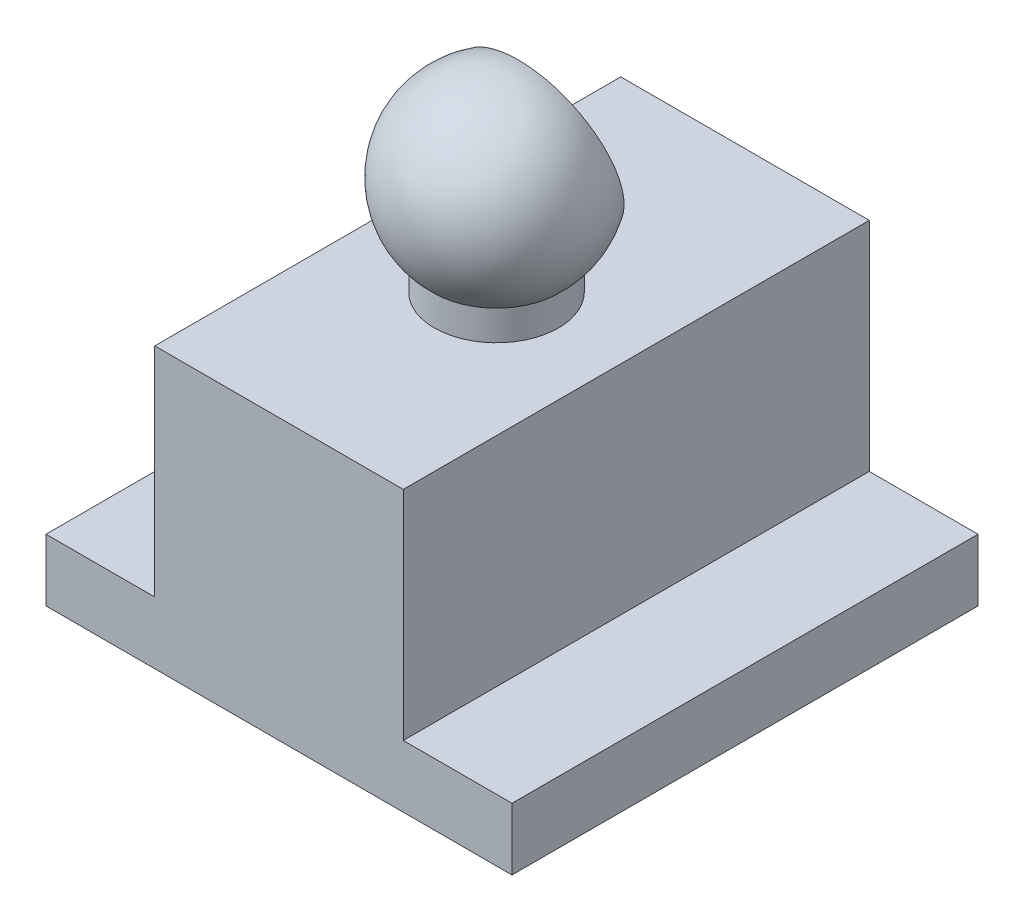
ISO-10303-21;
HEADER;
FILE_DESCRIPTION(('STEP AP214'),'2;1');
FILE_NAME('part.step','',(''),(''),'','','');
FILE_SCHEMA(('AUTOMOTIVE_DESIGN { 1 0 10303 214 1 1 1 1 }'));
ENDSEC;
DATA;
#1=APPLICATION_CONTEXT('core data for automotive mechanical design processes');
#2=APPLICATION_PROTOCOL_DEFINITION('international standard','automotive_design',2000,#1);
#3=PRODUCT_CONTEXT('',#1,'mechanical');
#4=PRODUCT('Part','Part','',(#3));
#5=PRODUCT_RELATED_PRODUCT_CATEGORY('part','',(#4));
#6=PRODUCT_DEFINITION_FORMATION('','',#4);
#7=PRODUCT_DEFINITION_CONTEXT('part definition',#1,'design');
#8=PRODUCT_DEFINITION('design','',#6,#7);
#9=PRODUCT_DEFINITION_SHAPE('','',#8);
#10=(LENGTH_UNIT() NAMED_UNIT(*) SI_UNIT(.MILLI.,.METRE.));
#11=(NAMED_UNIT(*) PLANE_ANGLE_UNIT() SI_UNIT($,.RADIAN.));
#12=(NAMED_UNIT(*) SI_UNIT($,.STERADIAN.) SOLID_ANGLE_UNIT());
#13=UNCERTAINTY_MEASURE_WITH_UNIT(LENGTH_MEASURE(1.E-05),#10,'distance_accuracy_value','');
#14=(GEOMETRIC_REPRESENTATION_CONTEXT(3) GLOBAL_UNCERTAINTY_ASSIGNED_CONTEXT((#13)) GLOBAL_UNIT_ASSIGNED_CONTEXT((#10,
#11,#12)) REPRESENTATION_CONTEXT('',''));
#15=CARTESIAN_POINT('',(0.,0.,0.));
#16=DIRECTION('',(0.,0.,1.));
#17=DIRECTION('',(1.,0.,0.));
#18=AXIS2_PLACEMENT_3D('',#15,#16,#17);
#19=CARTESIAN_POINT('',(20.,20.,-75.));
#20=DIRECTION('',(0.,1.,0.));
#21=DIRECTION('',(-1.,0.,0.));
#22=AXIS2_PLACEMENT_3D('',#19,#20,#21);
#23=PLANE('',#22);
#24=DIRECTION('',(-1.,0.,0.));
#25=VECTOR('',#24,1.);
#26=CARTESIAN_POINT('',(20.,20.,0.));
#27=LINE('',#26,#25);
#28=CARTESIAN_POINT('',(37.5,20.,0.));
#29=VERTEX_POINT('',#28);
#30=CARTESIAN_POINT('',(20.,20.,0.));
#31=VERTEX_POINT('',#30);
#32=EDGE_CURVE('E100',#29,#31,#27,.T.);
#33=ORIENTED_EDGE('',*,*,#32,.F.);
#34=DIRECTION('',(0.,0.,1.));
#35=VECTOR('',#34,1.);
#36=CARTESIAN_POINT('',(37.5,20.,-75.));
#37=LINE('',#36,#35);
#38=CARTESIAN_POINT('',(37.5,20.,-75.));
#39=VERTEX_POINT('',#38);
#40=EDGE_CURVE('E11',#39,#29,#37,.T.);
#41=ORIENTED_EDGE('',*,*,#40,.F.);
#42=DIRECTION('',(-1.,0.,0.));
#43=VECTOR('',#42,1.);
#44=CARTESIAN_POINT('',(20.,20.,-75.));
#45=LINE('',#44,#43);
#46=CARTESIAN_POINT('',(20.,20.,-75.));
#47=VERTEX_POINT('',#46);
#48=EDGE_CURVE('E102',#39,#47,#45,.T.);
#49=ORIENTED_EDGE('',*,*,#48,.T.);
#50=DIRECTION('',(0.,0.,1.));
#51=VECTOR('',#50,1.);
#52=CARTESIAN_POINT('',(20.,20.,-75.));
#53=LINE('',#52,#51);
#54=EDGE_CURVE('E39',#47,#31,#53,.T.);
#55=ORIENTED_EDGE('',*,*,#54,.T.);
#56=EDGE_LOOP('',(#33,#41,#49,#55));
#57=FACE_BOUND('',#56,.T.);
#58=ADVANCED_FACE('F36',(#57),#23,.T.);
#59=CARTESIAN_POINT('',(37.5,20.,-75.));
#60=DIRECTION('',(1.,0.,0.));
#61=DIRECTION('',(0.,0.,-1.));
#62=AXIS2_PLACEMENT_3D('',#59,#60,#61);
#63=PLANE('',#62);
#64=DIRECTION('',(0.,1.,0.));
#65=VECTOR('',#64,1.);
#66=CARTESIAN_POINT('',(37.5,20.,0.));
#67=LINE('',#66,#65);
#68=CARTESIAN_POINT('',(37.5,10.,0.));
#69=VERTEX_POINT('',#68);
#70=EDGE_CURVE('E118',#69,#29,#67,.T.);
#71=ORIENTED_EDGE('',*,*,#70,.F.);
#72=DIRECTION('',(0.,0.,1.));
#73=VECTOR('',#72,1.);
#74=CARTESIAN_POINT('',(37.5,10.,-75.));
#75=LINE('',#74,#73);
#76=CARTESIAN_POINT('',(37.5,10.,-75.));
#77=VERTEX_POINT('',#76);
#78=EDGE_CURVE('E44',#77,#69,#75,.T.);
#79=ORIENTED_EDGE('',*,*,#78,.F.);
#80=DIRECTION('',(0.,1.,0.));
#81=VECTOR('',#80,1.);
#82=CARTESIAN_POINT('',(37.5,20.,-75.));
#83=LINE('',#82,#81);
#84=EDGE_CURVE('E107',#77,#39,#83,.T.);
#85=ORIENTED_EDGE('',*,*,#84,.T.);
#86=ORIENTED_EDGE('',*,*,#40,.T.);
#87=EDGE_LOOP('',(#71,#79,#85,#86));
#88=FACE_BOUND('',#87,.T.);
#89=ADVANCED_FACE('F184',(#88),#63,.T.);
#90=CARTESIAN_POINT('',(37.5,10.,-75.));
#91=DIRECTION('',(0.,-1.,0.));
#92=DIRECTION('',(1.,0.,0.));
#93=AXIS2_PLACEMENT_3D('',#90,#91,#92);
#94=PLANE('',#93);
#95=DIRECTION('',(1.,0.,0.));
#96=VECTOR('',#95,1.);
#97=CARTESIAN_POINT('',(37.5,10.,0.));
#98=LINE('',#97,#96);
#99=CARTESIAN_POINT('',(-37.5,9.99999999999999,0.));
#100=VERTEX_POINT('',#99);
#101=EDGE_CURVE('E136',#100,#69,#98,.T.);
#102=ORIENTED_EDGE('',*,*,#101,.F.);
#103=DIRECTION('',(0.,0.,1.));
#104=VECTOR('',#103,1.);
#105=CARTESIAN_POINT('',(-37.5,9.99999999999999,-75.));
#106=LINE('',#105,#104);
#107=CARTESIAN_POINT('',(-37.5,9.99999999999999,-75.));
#108=VERTEX_POINT('',#107);
#109=EDGE_CURVE('E158',#108,#100,#106,.T.);
#110=ORIENTED_EDGE('',*,*,#109,.F.);
#111=DIRECTION('',(1.,0.,0.));
#112=VECTOR('',#111,1.);
#113=CARTESIAN_POINT('',(37.5,10.,-75.));
#114=LINE('',#113,#112);
#115=EDGE_CURVE('E154',#108,#77,#114,.T.);
#116=ORIENTED_EDGE('',*,*,#115,.T.);
#117=ORIENTED_EDGE('',*,*,#78,.T.);
#118=EDGE_LOOP('',(#102,#110,#116,#117));
#119=FACE_BOUND('',#118,.T.);
#120=ADVANCED_FACE('F183',(#119),#94,.T.);
#121=CARTESIAN_POINT('',(-37.5,9.99999999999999,-75.));
#122=DIRECTION('',(-1.,0.,0.));
#123=DIRECTION('',(0.,0.,1.));
#124=AXIS2_PLACEMENT_3D('',#121,#122,#123);
#125=PLANE('',#124);
#126=DIRECTION('',(0.,-1.,0.));
#127=VECTOR('',#126,1.);
#128=CARTESIAN_POINT('',(-37.5,9.99999999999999,0.));
#129=LINE('',#128,#127);
#130=CARTESIAN_POINT('',(-37.5,20.,0.));
#131=VERTEX_POINT('',#130);
#132=EDGE_CURVE('E133',#131,#100,#129,.T.);
#133=ORIENTED_EDGE('',*,*,#132,.F.);
#134=DIRECTION('',(0.,0.,1.));
#135=VECTOR('',#134,1.);
#136=CARTESIAN_POINT('',(-37.5,20.,-75.));
#137=LINE('',#136,#135);
#138=CARTESIAN_POINT('',(-37.5,20.,-75.));
#139=VERTEX_POINT('',#138);
#140=EDGE_CURVE('E160',#139,#131,#137,.T.);
#141=ORIENTED_EDGE('',*,*,#140,.F.);
#142=DIRECTION('',(0.,-1.,0.));
#143=VECTOR('',#142,1.);
#144=CARTESIAN_POINT('',(-37.5,9.99999999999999,-75.));
#145=LINE('',#144,#143);
#146=EDGE_CURVE('E151',#139,#108,#145,.T.);
#147=ORIENTED_EDGE('',*,*,#146,.T.);
#148=ORIENTED_EDGE('',*,*,#109,.T.);
#149=EDGE_LOOP('',(#133,#141,#147,#148));
#150=FACE_BOUND('',#149,.T.);
#151=ADVANCED_FACE('F179',(#150),#125,.T.);
#152=CARTESIAN_POINT('',(-37.5,20.,-75.));
#153=DIRECTION('',(0.,1.,0.));
#154=DIRECTION('',(-1.,0.,0.));
#155=AXIS2_PLACEMENT_3D('',#152,#153,#154);
#156=PLANE('',#155);
#157=DIRECTION('',(-1.,0.,0.));
#158=VECTOR('',#157,1.);
#159=CARTESIAN_POINT('',(-37.5,20.,0.));
#160=LINE('',#159,#158);
#161=CARTESIAN_POINT('',(-20.,20.,0.));
#162=VERTEX_POINT('',#161);
#163=EDGE_CURVE('E130',#162,#131,#160,.T.);
#164=ORIENTED_EDGE('',*,*,#163,.F.);
#165=DIRECTION('',(0.,0.,1.));
#166=VECTOR('',#165,1.);
#167=CARTESIAN_POINT('',(-20.,20.,-75.));
#168=LINE('',#167,#166);
#169=CARTESIAN_POINT('',(-20.,20.,-75.));
#170=VERTEX_POINT('',#169);
#171=EDGE_CURVE('E162',#170,#162,#168,.T.);
#172=ORIENTED_EDGE('',*,*,#171,.F.);
#173=DIRECTION('',(-1.,0.,0.));
#174=VECTOR('',#173,1.);
#175=CARTESIAN_POINT('',(-37.5,20.,-75.));
#176=LINE('',#175,#174);
#177=EDGE_CURVE('E148',#170,#139,#176,.T.);
#178=ORIENTED_EDGE('',*,*,#177,.T.);
#179=ORIENTED_EDGE('',*,*,#140,.T.);
#180=EDGE_LOOP('',(#164,#172,#178,#179));
#181=FACE_BOUND('',#180,.T.);
#182=ADVANCED_FACE('F175',(#181),#156,.T.);
#183=CARTESIAN_POINT('',(-20.,20.,-75.));
#184=DIRECTION('',(-1.,0.,0.));
#185=DIRECTION('',(0.,0.,1.));
#186=AXIS2_PLACEMENT_3D('',#183,#184,#185);
#187=PLANE('',#186);
#188=DIRECTION('',(0.,-1.,0.));
#189=VECTOR('',#188,1.);
#190=CARTESIAN_POINT('',(-20.,20.,0.));
#191=LINE('',#190,#189);
#192=CARTESIAN_POINT('',(-20.,55.,0.));
#193=VERTEX_POINT('',#192);
#194=EDGE_CURVE('E127',#193,#162,#191,.T.);
#195=ORIENTED_EDGE('',*,*,#194,.F.);
#196=DIRECTION('',(0.,0.,1.));
#197=VECTOR('',#196,1.);
#198=CARTESIAN_POINT('',(-20.,55.,-75.));
#199=LINE('',#198,#197);
#200=CARTESIAN_POINT('',(-20.,55.,-75.));
#201=VERTEX_POINT('',#200);
#202=EDGE_CURVE('E164',#201,#193,#199,.T.);
#203=ORIENTED_EDGE('',*,*,#202,.F.);
#204=DIRECTION('',(0.,-1.,0.));
#205=VECTOR('',#204,1.);
#206=CARTESIAN_POINT('',(-20.,20.,-75.));
#207=LINE('',#206,#205);
#208=EDGE_CURVE('E145',#201,#170,#207,.T.);
#209=ORIENTED_EDGE('',*,*,#208,.T.);
#210=ORIENTED_EDGE('',*,*,#171,.T.);
#211=EDGE_LOOP('',(#195,#203,#209,#210));
#212=FACE_BOUND('',#211,.T.);
#213=ADVANCED_FACE('F171',(#212),#187,.T.);
#214=CARTESIAN_POINT('',(-20.,55.,-75.));
#215=DIRECTION('',(0.,1.,0.));
#216=DIRECTION('',(0.,0.,1.));
#217=AXIS2_PLACEMENT_3D('',#214,#215,#216);
#218=PLANE('',#217);
#219=CARTESIAN_POINT('',(0.,55.,-35.));
#220=DIRECTION('',(0.,1.,0.));
#221=DIRECTION('',(0.,0.,1.));
#222=AXIS2_PLACEMENT_3D('',#219,#220,#221);
#223=CIRCLE('',#222,10.);
#224=CARTESIAN_POINT('',(0.,55.,-25.));
#225=VERTEX_POINT('',#224);
#226=EDGE_CURVE('E119',#225,#225,#223,.T.);
#227=ORIENTED_EDGE('',*,*,#226,.F.);
#228=EDGE_LOOP('',(#227));
#229=FACE_BOUND('',#228,.T.);
#230=DIRECTION('',(-1.,0.,0.));
#231=VECTOR('',#230,1.);
#232=CARTESIAN_POINT('',(-20.,55.,0.));
#233=LINE('',#232,#231);
#234=CARTESIAN_POINT('',(20.,55.,0.));
#235=VERTEX_POINT('',#234);
#236=EDGE_CURVE('E114',#235,#193,#233,.T.);
#237=ORIENTED_EDGE('',*,*,#236,.F.);
#238=DIRECTION('',(0.,0.,1.));
#239=VECTOR('',#238,1.);
#240=CARTESIAN_POINT('',(20.,55.,-75.));
#241=LINE('',#240,#239);
#242=CARTESIAN_POINT('',(20.,55.,-75.));
#243=VERTEX_POINT('',#242);
#244=EDGE_CURVE('E106',#243,#235,#241,.T.);
#245=ORIENTED_EDGE('',*,*,#244,.F.);
#246=DIRECTION('',(-1.,0.,0.));
#247=VECTOR('',#246,1.);
#248=CARTESIAN_POINT('',(-20.,55.,-75.));
#249=LINE('',#248,#247);
#250=EDGE_CURVE('E142',#243,#201,#249,.T.);
#251=ORIENTED_EDGE('',*,*,#250,.T.);
#252=ORIENTED_EDGE('',*,*,#202,.T.);
#253=EDGE_LOOP('',(#237,#245,#251,#252));
#254=FACE_BOUND('',#253,.T.);
#255=ADVANCED_FACE('F167',(#229,#254),#218,.T.);
#256=CARTESIAN_POINT('',(20.,55.,-75.));
#257=DIRECTION('',(1.,0.,0.));
#258=DIRECTION('',(0.,0.,-1.));
#259=AXIS2_PLACEMENT_3D('',#256,#257,#258);
#260=PLANE('',#259);
#261=DIRECTION('',(0.,1.,0.));
#262=VECTOR('',#261,1.);
#263=CARTESIAN_POINT('',(20.,55.,0.));
#264=LINE('',#263,#262);
#265=EDGE_CURVE('E109',#31,#235,#264,.T.);
#266=ORIENTED_EDGE('',*,*,#265,.F.);
#267=ORIENTED_EDGE('',*,*,#54,.F.);
#268=DIRECTION('',(0.,1.,0.));
#269=VECTOR('',#268,1.);
#270=CARTESIAN_POINT('',(20.,55.,-75.));
#271=LINE('',#270,#269);
#272=EDGE_CURVE('E140',#47,#243,#271,.T.);
#273=ORIENTED_EDGE('',*,*,#272,.T.);
#274=ORIENTED_EDGE('',*,*,#244,.T.);
#275=EDGE_LOOP('',(#266,#267,#273,#274));
#276=FACE_BOUND('',#275,.T.);
#277=ADVANCED_FACE('F110',(#276),#260,.T.);
#278=CARTESIAN_POINT('',(37.5,20.,-75.));
#279=DIRECTION('',(0.,0.,-1.));
#280=DIRECTION('',(-1.,0.,0.));
#281=AXIS2_PLACEMENT_3D('',#278,#279,#280);
#282=PLANE('',#281);
#283=ORIENTED_EDGE('',*,*,#48,.F.);
#284=ORIENTED_EDGE('',*,*,#84,.F.);
#285=ORIENTED_EDGE('',*,*,#115,.F.);
#286=ORIENTED_EDGE('',*,*,#146,.F.);
#287=ORIENTED_EDGE('',*,*,#177,.F.);
#288=ORIENTED_EDGE('',*,*,#208,.F.);
#289=ORIENTED_EDGE('',*,*,#250,.F.);
#290=ORIENTED_EDGE('',*,*,#272,.F.);
#291=EDGE_LOOP('',(#283,#284,#285,#286,#287,#288,#289,#290));
#292=FACE_BOUND('',#291,.T.);
#293=ADVANCED_FACE('F187',(#292),#282,.T.);
#294=CARTESIAN_POINT('',(37.5,20.,0.));
#295=DIRECTION('',(0.,0.,-1.));
#296=DIRECTION('',(-1.,0.,0.));
#297=AXIS2_PLACEMENT_3D('',#294,#295,#296);
#298=PLANE('',#297);
#299=ORIENTED_EDGE('',*,*,#32,.T.);
#300=ORIENTED_EDGE('',*,*,#265,.T.);
#301=ORIENTED_EDGE('',*,*,#236,.T.);
#302=ORIENTED_EDGE('',*,*,#194,.T.);
#303=ORIENTED_EDGE('',*,*,#163,.T.);
#304=ORIENTED_EDGE('',*,*,#132,.T.);
#305=ORIENTED_EDGE('',*,*,#101,.T.);
#306=ORIENTED_EDGE('',*,*,#70,.T.);
#307=EDGE_LOOP('',(#299,#300,#301,#302,#303,#304,#305,#306));
#308=FACE_BOUND('',#307,.T.);
#309=ADVANCED_FACE('F116',(#308),#298,.F.);
#310=CARTESIAN_POINT('',(0.,86.,-35.));
#311=DIRECTION('',(0.,1.,0.));
#312=DIRECTION('',(-1.,0.,0.));
#313=AXIS2_PLACEMENT_3D('',#310,#311,#312);
#314=CYLINDRICAL_SURFACE('',#313,10.);
#315=ORIENTED_EDGE('',*,*,#226,.T.);
#316=EDGE_LOOP('',(#315));
#317=FACE_BOUND('',#316,.T.);
#318=CARTESIAN_POINT('',(0.,59.8196601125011,-35.));
#319=DIRECTION('',(0.,1.,0.));
#320=DIRECTION('',(-1.,0.,0.));
#321=AXIS2_PLACEMENT_3D('',#318,#319,#320);
#322=CIRCLE('',#321,10.);
#323=CARTESIAN_POINT('',(-9.99999999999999,59.8196601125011,-35.));
#324=VERTEX_POINT('',#323);
#325=EDGE_CURVE('E122',#324,#324,#322,.T.);
#326=ORIENTED_EDGE('',*,*,#325,.F.);
#327=EDGE_LOOP('',(#326));
#328=FACE_BOUND('',#327,.T.);
#329=ADVANCED_FACE('F194',(#317,#328),#314,.T.);
#330=CARTESIAN_POINT('',(0.,71.,-35.));
#331=DIRECTION('',(0.,1.,0.));
#332=DIRECTION('',(0.,0.,1.));
#333=AXIS2_PLACEMENT_3D('',#330,#331,#332);
#334=SPHERICAL_SURFACE('',#333,15.);
#335=CARTESIAN_POINT('',(0.,72.8606144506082,-41.9439076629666));
#336=DIRECTION('',(0.,-0.258819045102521,0.965925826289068));
#337=DIRECTION('',(0.,0.965925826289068,0.258819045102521));
#338=AXIS2_PLACEMENT_3D('',#335,#336,#337);
#339=CIRCLE('',#338,13.1651152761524);
#340=CARTESIAN_POINT('',(0.,85.5771393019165,-38.5365250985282));
#341=VERTEX_POINT('',#340);
#342=EDGE_CURVE('E225',#341,#341,#339,.T.);
#343=ORIENTED_EDGE('',*,*,#342,.T.);
#344=EDGE_LOOP('',(#343));
#345=FACE_BOUND('',#344,.T.);
#346=ORIENTED_EDGE('',*,*,#325,.T.);
#347=EDGE_LOOP('',(#346));
#348=FACE_BOUND('',#347,.T.);
#349=ADVANCED_FACE('F220',(#345,#348),#334,.T.);
#350=CARTESIAN_POINT('',(0.,70.1337977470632,-31.7672891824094));
#351=DIRECTION('',(0.,0.258819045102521,-0.965925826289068));
#352=DIRECTION('',(0.,-0.965925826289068,-0.258819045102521));
#353=AXIS2_PLACEMENT_3D('',#350,#351,#352);
#354=CONICAL_SURFACE('',#353,9.4233366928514,0.341260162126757);
#355=CARTESIAN_POINT('',(0.,70.1337977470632,-31.7672891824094));
#356=DIRECTION('',(0.,-0.258819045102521,0.965925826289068));
#357=DIRECTION('',(0.,0.965925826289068,0.258819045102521));
#358=AXIS2_PLACEMENT_3D('',#355,#356,#357);
#359=CIRCLE('',#358,9.42333669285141);
#360=CARTESIAN_POINT('',(0.,79.2360420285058,-29.328350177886));
#361=VERTEX_POINT('',#360);
#362=EDGE_CURVE('E228',#361,#361,#359,.T.);
#363=ORIENTED_EDGE('',*,*,#362,.T.);
#364=EDGE_LOOP('',(#363));
#365=FACE_BOUND('',#364,.T.);
#366=ORIENTED_EDGE('',*,*,#342,.F.);
#367=EDGE_LOOP('',(#366));
#368=FACE_BOUND('',#367,.T.);
#369=ADVANCED_FACE('F233',(#365,#368),#354,.F.);
#370=CARTESIAN_POINT('',(0.,71.,-35.));
#371=DIRECTION('',(0.,-0.258819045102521,0.965925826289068));
#372=DIRECTION('',(0.,0.965925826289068,0.258819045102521));
#373=AXIS2_PLACEMENT_3D('',#370,#371,#372);
#374=SPHERICAL_SURFACE('',#373,10.);
#375=ORIENTED_EDGE('',*,*,#362,.F.);
#376=EDGE_LOOP('',(#375));
#377=FACE_BOUND('',#376,.T.);
#378=ADVANCED_FACE('F236',(#377),#374,.F.);
#379=CLOSED_SHELL('',(#58,#89,#120,#151,#182,#213,#255,#277,#293,#309,#329,#349,#369,#378));
#380=MANIFOLD_SOLID_BREP('B2',#379);
#381=ADVANCED_BREP_SHAPE_REPRESENTATION('',(#18,#380),#14);
#382=SHAPE_DEFINITION_REPRESENTATION(#9,#381);
ENDSEC;
END-ISO-10303-21;
